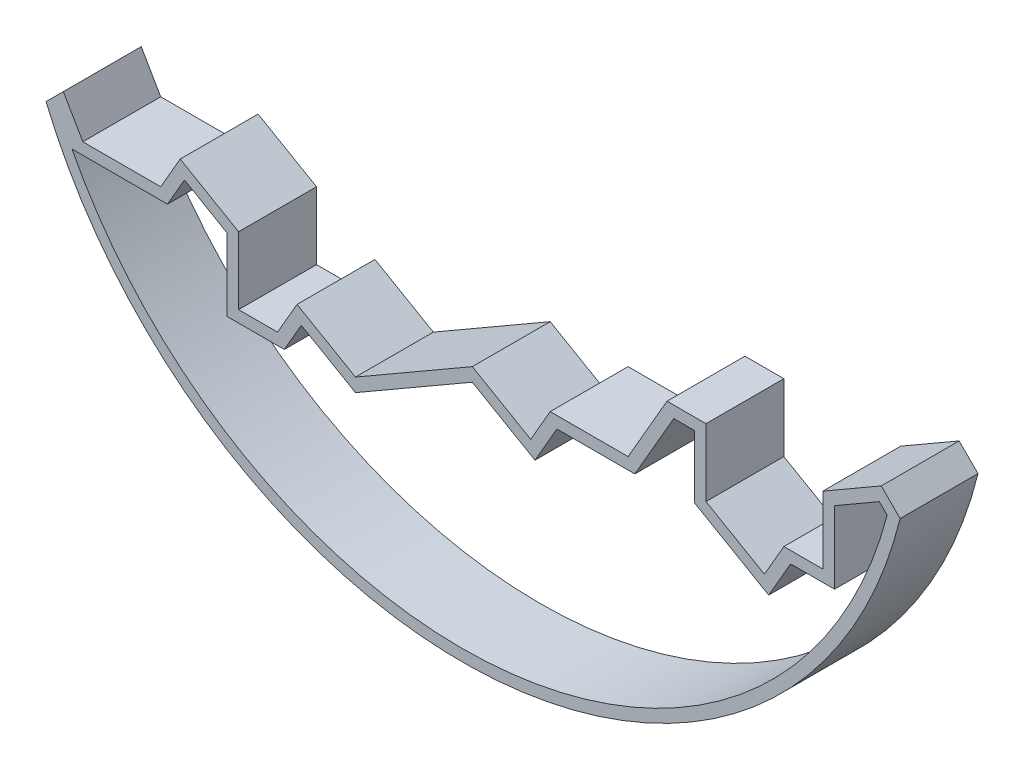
ISO-10303-21;
HEADER;
FILE_DESCRIPTION(('STEP AP214'),'2;1');
FILE_NAME('part.step','',(''),(''),'','','');
FILE_SCHEMA(('AUTOMOTIVE_DESIGN { 1 0 10303 214 1 1 1 1 }'));
ENDSEC;
DATA;
#1=APPLICATION_CONTEXT('core data for automotive mechanical design processes');
#2=APPLICATION_PROTOCOL_DEFINITION('international standard','automotive_design',2000,#1);
#3=PRODUCT_CONTEXT('',#1,'mechanical');
#4=PRODUCT('Part','Part','',(#3));
#5=PRODUCT_RELATED_PRODUCT_CATEGORY('part','',(#4));
#6=PRODUCT_DEFINITION_FORMATION('','',#4);
#7=PRODUCT_DEFINITION_CONTEXT('part definition',#1,'design');
#8=PRODUCT_DEFINITION('design','',#6,#7);
#9=PRODUCT_DEFINITION_SHAPE('','',#8);
#10=(LENGTH_UNIT() NAMED_UNIT(*) SI_UNIT(.MILLI.,.METRE.));
#11=(NAMED_UNIT(*) PLANE_ANGLE_UNIT() SI_UNIT($,.RADIAN.));
#12=(NAMED_UNIT(*) SI_UNIT($,.STERADIAN.) SOLID_ANGLE_UNIT());
#13=UNCERTAINTY_MEASURE_WITH_UNIT(LENGTH_MEASURE(1.E-05),#10,'distance_accuracy_value','');
#14=(GEOMETRIC_REPRESENTATION_CONTEXT(3) GLOBAL_UNCERTAINTY_ASSIGNED_CONTEXT((#13)) GLOBAL_UNIT_ASSIGNED_CONTEXT((#10,
#11,#12)) REPRESENTATION_CONTEXT('',''));
#15=CARTESIAN_POINT('',(0.,0.,0.));
#16=DIRECTION('',(0.,0.,1.));
#17=DIRECTION('',(1.,0.,0.));
#18=AXIS2_PLACEMENT_3D('',#15,#16,#17);
#19=CARTESIAN_POINT('',(-79.0600462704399,68.9861351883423,20.));
#20=DIRECTION('',(0.,0.,1.));
#21=DIRECTION('',(1.,0.,0.));
#22=AXIS2_PLACEMENT_3D('',#19,#20,#21);
#23=PLANE('',#22);
#24=DIRECTION('',(-0.707106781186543,-0.707106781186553,0.));
#25=VECTOR('',#24,1.);
#26=CARTESIAN_POINT('',(-181.460670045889,28.8101193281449,20.));
#27=LINE('',#26,#25);
#28=CARTESIAN_POINT('',(-181.460670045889,28.8101193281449,20.));
#29=VERTEX_POINT('',#28);
#30=CARTESIAN_POINT('',(-185.917059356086,24.3537300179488,20.));
#31=VERTEX_POINT('',#30);
#32=EDGE_CURVE('E470',#29,#31,#27,.T.);
#33=ORIENTED_EDGE('',*,*,#32,.T.);
#34=CARTESIAN_POINT('',(-79.0600462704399,68.9861351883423,20.));
#35=DIRECTION('',(0.,0.,1.));
#36=DIRECTION('',(1.,0.,0.));
#37=AXIS2_PLACEMENT_3D('',#34,#35,#36);
#38=CIRCLE('',#37,115.803595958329);
#39=CARTESIAN_POINT('',(33.3822497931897,41.2877075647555,20.));
#40=VERTEX_POINT('',#39);
#41=EDGE_CURVE('E473',#31,#40,#38,.T.);
#42=ORIENTED_EDGE('',*,*,#41,.T.);
#43=DIRECTION('',(-0.707106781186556,0.707106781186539,0.));
#44=VECTOR('',#43,1.);
#45=CARTESIAN_POINT('',(28.53932995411,46.1306274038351,20.));
#46=LINE('',#45,#44);
#47=CARTESIAN_POINT('',(28.53932995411,46.1306274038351,20.));
#48=VERTEX_POINT('',#47);
#49=EDGE_CURVE('E476',#40,#48,#46,.T.);
#50=ORIENTED_EDGE('',*,*,#49,.T.);
#51=DIRECTION('',(-0.866025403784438,-0.500000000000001,0.));
#52=VECTOR('',#51,1.);
#53=CARTESIAN_POINT('',(13.53932995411,37.4703733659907,20.));
#54=LINE('',#53,#52);
#55=CARTESIAN_POINT('',(13.53932995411,37.4703733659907,20.));
#56=VERTEX_POINT('',#55);
#57=EDGE_CURVE('E478',#48,#56,#54,.T.);
#58=ORIENTED_EDGE('',*,*,#57,.T.);
#59=DIRECTION('',(0.,-1.,0.));
#60=VECTOR('',#59,1.);
#61=CARTESIAN_POINT('',(13.53932995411,20.1498652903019,20.));
#62=LINE('',#61,#60);
#63=CARTESIAN_POINT('',(13.53932995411,20.1498652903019,20.));
#64=VERTEX_POINT('',#63);
#65=EDGE_CURVE('E480',#56,#64,#62,.T.);
#66=ORIENTED_EDGE('',*,*,#65,.T.);
#67=DIRECTION('',(-1.,0.,0.));
#68=VECTOR('',#67,1.);
#69=CARTESIAN_POINT('',(3.53932995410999,20.1498652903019,20.));
#70=LINE('',#69,#68);
#71=CARTESIAN_POINT('',(3.53932995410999,20.1498652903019,20.));
#72=VERTEX_POINT('',#71);
#73=EDGE_CURVE('E482',#64,#72,#70,.T.);
#74=ORIENTED_EDGE('',*,*,#73,.T.);
#75=DIRECTION('',(-0.499999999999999,-0.866025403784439,0.));
#76=VECTOR('',#75,1.);
#77=CARTESIAN_POINT('',(-1.46067004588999,11.4896112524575,20.));
#78=LINE('',#77,#76);
#79=CARTESIAN_POINT('',(-1.46067004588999,11.4896112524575,20.));
#80=VERTEX_POINT('',#79);
#81=EDGE_CURVE('E484',#72,#80,#78,.T.);
#82=ORIENTED_EDGE('',*,*,#81,.T.);
#83=DIRECTION('',(-0.866025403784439,0.5,0.));
#84=VECTOR('',#83,1.);
#85=CARTESIAN_POINT('',(-16.46067004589,20.1498652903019,20.));
#86=LINE('',#85,#84);
#87=CARTESIAN_POINT('',(-16.46067004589,20.1498652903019,20.));
#88=VERTEX_POINT('',#87);
#89=EDGE_CURVE('E486',#80,#88,#86,.T.);
#90=ORIENTED_EDGE('',*,*,#89,.T.);
#91=DIRECTION('',(0.,1.,0.));
#92=VECTOR('',#91,1.);
#93=CARTESIAN_POINT('',(-16.46067004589,37.4703733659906,20.));
#94=LINE('',#93,#92);
#95=CARTESIAN_POINT('',(-16.46067004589,37.4703733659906,20.));
#96=VERTEX_POINT('',#95);
#97=EDGE_CURVE('E488',#88,#96,#94,.T.);
#98=ORIENTED_EDGE('',*,*,#97,.T.);
#99=DIRECTION('',(-1.,0.,0.));
#100=VECTOR('',#99,1.);
#101=CARTESIAN_POINT('',(-26.4606700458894,37.4703733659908,20.));
#102=LINE('',#101,#100);
#103=CARTESIAN_POINT('',(-26.4606700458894,37.4703733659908,20.));
#104=VERTEX_POINT('',#103);
#105=EDGE_CURVE('E490',#96,#104,#102,.T.);
#106=ORIENTED_EDGE('',*,*,#105,.T.);
#107=DIRECTION('',(-0.499999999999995,-0.866025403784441,0.));
#108=VECTOR('',#107,1.);
#109=CARTESIAN_POINT('',(-36.4606700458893,20.1498652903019,20.));
#110=LINE('',#109,#108);
#111=CARTESIAN_POINT('',(-36.4606700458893,20.1498652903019,20.));
#112=VERTEX_POINT('',#111);
#113=EDGE_CURVE('E492',#104,#112,#110,.T.);
#114=ORIENTED_EDGE('',*,*,#113,.T.);
#115=DIRECTION('',(-1.,0.,0.));
#116=VECTOR('',#115,1.);
#117=CARTESIAN_POINT('',(-56.4606700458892,20.149865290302,20.));
#118=LINE('',#117,#116);
#119=CARTESIAN_POINT('',(-56.4606700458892,20.149865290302,20.));
#120=VERTEX_POINT('',#119);
#121=EDGE_CURVE('E494',#112,#120,#118,.T.);
#122=ORIENTED_EDGE('',*,*,#121,.T.);
#123=DIRECTION('',(-0.499999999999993,-0.866025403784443,0.));
#124=VECTOR('',#123,1.);
#125=CARTESIAN_POINT('',(-61.4606700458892,11.4896112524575,20.));
#126=LINE('',#125,#124);
#127=CARTESIAN_POINT('',(-61.4606700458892,11.4896112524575,20.));
#128=VERTEX_POINT('',#127);
#129=EDGE_CURVE('E496',#120,#128,#126,.T.);
#130=ORIENTED_EDGE('',*,*,#129,.T.);
#131=DIRECTION('',(-0.866025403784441,0.499999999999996,0.));
#132=VECTOR('',#131,1.);
#133=CARTESIAN_POINT('',(-76.4606700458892,20.1498652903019,20.));
#134=LINE('',#133,#132);
#135=CARTESIAN_POINT('',(-76.4606700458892,20.1498652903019,20.));
#136=VERTEX_POINT('',#135);
#137=EDGE_CURVE('E498',#128,#136,#134,.T.);
#138=ORIENTED_EDGE('',*,*,#137,.T.);
#139=DIRECTION('',(-0.866025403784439,-0.499999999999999,0.));
#140=VECTOR('',#139,1.);
#141=CARTESIAN_POINT('',(-106.460670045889,2.82935721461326,20.));
#142=LINE('',#141,#140);
#143=CARTESIAN_POINT('',(-106.460670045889,2.82935721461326,20.));
#144=VERTEX_POINT('',#143);
#145=EDGE_CURVE('E500',#136,#144,#142,.T.);
#146=ORIENTED_EDGE('',*,*,#145,.T.);
#147=DIRECTION('',(-0.866025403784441,0.499999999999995,0.));
#148=VECTOR('',#147,1.);
#149=CARTESIAN_POINT('',(-121.460670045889,11.4896112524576,20.));
#150=LINE('',#149,#148);
#151=CARTESIAN_POINT('',(-121.460670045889,11.4896112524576,20.));
#152=VERTEX_POINT('',#151);
#153=EDGE_CURVE('E502',#144,#152,#150,.T.);
#154=ORIENTED_EDGE('',*,*,#153,.T.);
#155=DIRECTION('',(-0.499999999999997,-0.86602540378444,0.));
#156=VECTOR('',#155,1.);
#157=CARTESIAN_POINT('',(-126.460670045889,2.82935721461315,20.));
#158=LINE('',#157,#156);
#159=CARTESIAN_POINT('',(-126.460670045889,2.82935721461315,20.));
#160=VERTEX_POINT('',#159);
#161=EDGE_CURVE('E504',#152,#160,#158,.T.);
#162=ORIENTED_EDGE('',*,*,#161,.T.);
#163=DIRECTION('',(-1.,0.,0.));
#164=VECTOR('',#163,1.);
#165=CARTESIAN_POINT('',(-136.460670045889,2.82935721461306,20.));
#166=LINE('',#165,#164);
#167=CARTESIAN_POINT('',(-136.460670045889,2.82935721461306,20.));
#168=VERTEX_POINT('',#167);
#169=EDGE_CURVE('E506',#160,#168,#166,.T.);
#170=ORIENTED_EDGE('',*,*,#169,.T.);
#171=DIRECTION('',(0.,1.,0.));
#172=VECTOR('',#171,1.);
#173=CARTESIAN_POINT('',(-136.460670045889,20.1498652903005,20.));
#174=LINE('',#173,#172);
#175=CARTESIAN_POINT('',(-136.460670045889,20.1498652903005,20.));
#176=VERTEX_POINT('',#175);
#177=EDGE_CURVE('E508',#168,#176,#174,.T.);
#178=ORIENTED_EDGE('',*,*,#177,.T.);
#179=DIRECTION('',(-0.866025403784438,0.500000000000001,0.));
#180=VECTOR('',#179,1.);
#181=CARTESIAN_POINT('',(-151.460670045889,28.8101193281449,20.));
#182=LINE('',#181,#180);
#183=CARTESIAN_POINT('',(-151.460670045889,28.8101193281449,20.));
#184=VERTEX_POINT('',#183);
#185=EDGE_CURVE('E510',#176,#184,#182,.T.);
#186=ORIENTED_EDGE('',*,*,#185,.T.);
#187=DIRECTION('',(-0.5,-0.866025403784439,0.));
#188=VECTOR('',#187,1.);
#189=CARTESIAN_POINT('',(-156.460670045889,20.1498652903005,20.));
#190=LINE('',#189,#188);
#191=CARTESIAN_POINT('',(-156.460670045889,20.1498652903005,20.));
#192=VERTEX_POINT('',#191);
#193=EDGE_CURVE('E512',#184,#192,#190,.T.);
#194=ORIENTED_EDGE('',*,*,#193,.T.);
#195=DIRECTION('',(-1.,0.,0.));
#196=VECTOR('',#195,1.);
#197=CARTESIAN_POINT('',(-176.460670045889,20.1498652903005,20.));
#198=LINE('',#197,#196);
#199=CARTESIAN_POINT('',(-176.460670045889,20.1498652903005,20.));
#200=VERTEX_POINT('',#199);
#201=EDGE_CURVE('E514',#192,#200,#198,.T.);
#202=ORIENTED_EDGE('',*,*,#201,.T.);
#203=DIRECTION('',(-0.5,0.866025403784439,0.));
#204=VECTOR('',#203,1.);
#205=CARTESIAN_POINT('',(-181.460670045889,28.8101193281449,20.));
#206=LINE('',#205,#204);
#207=EDGE_CURVE('E516',#200,#29,#206,.T.);
#208=ORIENTED_EDGE('',*,*,#207,.T.);
#209=EDGE_LOOP('',(#33,#42,#50,#58,#66,#74,#82,#90,#98,#106,#114,#122,#130,#138,#146,#154,#162,
#170,#178,#186,#194,#202,#208));
#210=FACE_BOUND('',#209,.T.);
#211=DIRECTION('',(-0.500000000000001,-0.866025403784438,0.));
#212=VECTOR('',#211,1.);
#213=CARTESIAN_POINT('',(-154.728619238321,17.1498652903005,20.));
#214=LINE('',#213,#212);
#215=CARTESIAN_POINT('',(-150.362593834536,24.7120431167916,20.));
#216=VERTEX_POINT('',#215);
#217=CARTESIAN_POINT('',(-154.728619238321,17.1498652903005,20.));
#218=VERTEX_POINT('',#217);
#219=EDGE_CURVE('E322',#216,#218,#214,.T.);
#220=ORIENTED_EDGE('',*,*,#219,.F.);
#221=DIRECTION('',(-0.866025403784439,0.5,0.));
#222=VECTOR('',#221,1.);
#223=CARTESIAN_POINT('',(-150.362593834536,24.7120431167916,20.));
#224=LINE('',#223,#222);
#225=CARTESIAN_POINT('',(-139.460670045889,18.4178144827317,20.));
#226=VERTEX_POINT('',#225);
#227=EDGE_CURVE('E314',#226,#216,#224,.T.);
#228=ORIENTED_EDGE('',*,*,#227,.F.);
#229=DIRECTION('',(0.,1.,0.));
#230=VECTOR('',#229,1.);
#231=CARTESIAN_POINT('',(-139.460670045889,18.4178144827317,20.));
#232=LINE('',#231,#230);
#233=CARTESIAN_POINT('',(-139.460670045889,-0.170642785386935,20.));
#234=VERTEX_POINT('',#233);
#235=EDGE_CURVE('E373',#234,#226,#232,.T.);
#236=ORIENTED_EDGE('',*,*,#235,.F.);
#237=DIRECTION('',(-1.,0.,0.));
#238=VECTOR('',#237,1.);
#239=CARTESIAN_POINT('',(-139.460670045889,-0.170642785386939,20.));
#240=LINE('',#239,#238);
#241=CARTESIAN_POINT('',(-124.72861923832,-0.170642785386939,20.));
#242=VERTEX_POINT('',#241);
#243=EDGE_CURVE('E371',#242,#234,#240,.T.);
#244=ORIENTED_EDGE('',*,*,#243,.F.);
#245=DIRECTION('',(-0.5,-0.866025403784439,0.));
#246=VECTOR('',#245,1.);
#247=CARTESIAN_POINT('',(-124.72861923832,-0.170642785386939,20.));
#248=LINE('',#247,#246);
#249=CARTESIAN_POINT('',(-120.362593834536,7.39153504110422,20.));
#250=VERTEX_POINT('',#249);
#251=EDGE_CURVE('E369',#250,#242,#248,.T.);
#252=ORIENTED_EDGE('',*,*,#251,.F.);
#253=DIRECTION('',(-0.866025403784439,0.5,0.));
#254=VECTOR('',#253,1.);
#255=CARTESIAN_POINT('',(-120.362593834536,7.39153504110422,20.));
#256=LINE('',#255,#254);
#257=CARTESIAN_POINT('',(-106.460670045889,-0.634744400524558,20.));
#258=VERTEX_POINT('',#257);
#259=EDGE_CURVE('E367',#258,#250,#256,.T.);
#260=ORIENTED_EDGE('',*,*,#259,.F.);
#261=DIRECTION('',(-0.866025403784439,-0.5,0.));
#262=VECTOR('',#261,1.);
#263=CARTESIAN_POINT('',(-106.460670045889,-0.634744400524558,20.));
#264=LINE('',#263,#262);
#265=CARTESIAN_POINT('',(-76.4606700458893,16.6857636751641,20.));
#266=VERTEX_POINT('',#265);
#267=EDGE_CURVE('E365',#266,#258,#264,.T.);
#268=ORIENTED_EDGE('',*,*,#267,.F.);
#269=DIRECTION('',(-0.866025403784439,0.5,0.));
#270=VECTOR('',#269,1.);
#271=CARTESIAN_POINT('',(-76.4606700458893,16.6857636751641,20.));
#272=LINE('',#271,#270);
#273=CARTESIAN_POINT('',(-60.3625938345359,7.39153504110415,20.));
#274=VERTEX_POINT('',#273);
#275=EDGE_CURVE('E363',#274,#266,#272,.T.);
#276=ORIENTED_EDGE('',*,*,#275,.F.);
#277=DIRECTION('',(-0.5,-0.866025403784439,0.));
#278=VECTOR('',#277,1.);
#279=CARTESIAN_POINT('',(-60.3625938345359,7.39153504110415,20.));
#280=LINE('',#279,#278);
#281=CARTESIAN_POINT('',(-54.7286192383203,17.149865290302,20.));
#282=VERTEX_POINT('',#281);
#283=EDGE_CURVE('E361',#282,#274,#280,.T.);
#284=ORIENTED_EDGE('',*,*,#283,.F.);
#285=DIRECTION('',(-1.,0.,0.));
#286=VECTOR('',#285,1.);
#287=CARTESIAN_POINT('',(-54.7286192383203,17.149865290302,20.));
#288=LINE('',#287,#286);
#289=CARTESIAN_POINT('',(-34.7286192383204,17.149865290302,20.));
#290=VERTEX_POINT('',#289);
#291=EDGE_CURVE('E359',#290,#282,#288,.T.);
#292=ORIENTED_EDGE('',*,*,#291,.F.);
#293=DIRECTION('',(-0.5,-0.866025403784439,0.));
#294=VECTOR('',#293,1.);
#295=CARTESIAN_POINT('',(-34.7286192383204,17.149865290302,20.));
#296=LINE('',#295,#294);
#297=CARTESIAN_POINT('',(-24.7286192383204,34.4703733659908,20.));
#298=VERTEX_POINT('',#297);
#299=EDGE_CURVE('E357',#298,#290,#296,.T.);
#300=ORIENTED_EDGE('',*,*,#299,.F.);
#301=DIRECTION('',(-1.,0.,0.));
#302=VECTOR('',#301,1.);
#303=CARTESIAN_POINT('',(-24.7286192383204,34.4703733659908,20.));
#304=LINE('',#303,#302);
#305=CARTESIAN_POINT('',(-19.46067004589,34.4703733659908,20.));
#306=VERTEX_POINT('',#305);
#307=EDGE_CURVE('E355',#306,#298,#304,.T.);
#308=ORIENTED_EDGE('',*,*,#307,.F.);
#309=DIRECTION('',(0.,1.,0.));
#310=VECTOR('',#309,1.);
#311=CARTESIAN_POINT('',(-19.46067004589,34.4703733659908,20.));
#312=LINE('',#311,#310);
#313=CARTESIAN_POINT('',(-19.46067004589,18.417814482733,20.));
#314=VERTEX_POINT('',#313);
#315=EDGE_CURVE('E353',#314,#306,#312,.T.);
#316=ORIENTED_EDGE('',*,*,#315,.F.);
#317=DIRECTION('',(-0.866025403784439,0.5,0.));
#318=VECTOR('',#317,1.);
#319=CARTESIAN_POINT('',(-19.46067004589,18.417814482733,20.));
#320=LINE('',#319,#318);
#321=CARTESIAN_POINT('',(-0.362593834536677,7.3915350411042,20.));
#322=VERTEX_POINT('',#321);
#323=EDGE_CURVE('E351',#322,#314,#320,.T.);
#324=ORIENTED_EDGE('',*,*,#323,.F.);
#325=DIRECTION('',(-0.5,-0.866025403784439,0.));
#326=VECTOR('',#325,1.);
#327=CARTESIAN_POINT('',(-0.362593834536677,7.3915350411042,20.));
#328=LINE('',#327,#326);
#329=CARTESIAN_POINT('',(5.27138076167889,17.1498652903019,20.));
#330=VERTEX_POINT('',#329);
#331=EDGE_CURVE('E349',#330,#322,#328,.T.);
#332=ORIENTED_EDGE('',*,*,#331,.F.);
#333=DIRECTION('',(-1.,0.,0.));
#334=VECTOR('',#333,1.);
#335=CARTESIAN_POINT('',(5.27138076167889,17.1498652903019,20.));
#336=LINE('',#335,#334);
#337=CARTESIAN_POINT('',(16.53932995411,17.1498652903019,20.));
#338=VERTEX_POINT('',#337);
#339=EDGE_CURVE('E347',#338,#330,#336,.T.);
#340=ORIENTED_EDGE('',*,*,#339,.F.);
#341=DIRECTION('',(0.,-1.,0.));
#342=VECTOR('',#341,1.);
#343=CARTESIAN_POINT('',(16.53932995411,17.1498652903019,20.));
#344=LINE('',#343,#342);
#345=CARTESIAN_POINT('',(16.53932995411,35.7383225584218,20.));
#346=VERTEX_POINT('',#345);
#347=EDGE_CURVE('E345',#346,#338,#344,.T.);
#348=ORIENTED_EDGE('',*,*,#347,.F.);
#349=DIRECTION('',(-0.866025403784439,-0.5,0.));
#350=VECTOR('',#349,1.);
#351=CARTESIAN_POINT('',(16.53932995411,35.7383225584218,20.));
#352=LINE('',#351,#350);
#353=CARTESIAN_POINT('',(28.0457559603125,42.3815607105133,20.));
#354=VERTEX_POINT('',#353);
#355=EDGE_CURVE('E343',#354,#346,#352,.T.);
#356=ORIENTED_EDGE('',*,*,#355,.F.);
#357=DIRECTION('',(-0.707106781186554,0.707106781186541,0.));
#358=VECTOR('',#357,1.);
#359=CARTESIAN_POINT('',(28.0457559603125,42.3815607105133,20.));
#360=LINE('',#359,#358);
#361=CARTESIAN_POINT('',(30.0543005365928,40.373016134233,20.));
#362=VERTEX_POINT('',#361);
#363=EDGE_CURVE('E341',#362,#354,#360,.T.);
#364=ORIENTED_EDGE('',*,*,#363,.F.);
#365=CARTESIAN_POINT('',(-79.0600462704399,68.9861351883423,20.));
#366=DIRECTION('',(0.,0.,1.));
#367=DIRECTION('',(1.,0.,0.));
#368=AXIS2_PLACEMENT_3D('',#365,#366,#367);
#369=CIRCLE('',#368,112.803595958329);
#370=CARTESIAN_POINT('',(-179.248131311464,17.1498652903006,20.));
#371=VERTEX_POINT('',#370);
#372=EDGE_CURVE('E337',#371,#362,#369,.T.);
#373=ORIENTED_EDGE('',*,*,#372,.F.);
#374=DIRECTION('',(-1.,0.,0.));
#375=VECTOR('',#374,1.);
#376=CARTESIAN_POINT('',(-179.248131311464,17.1498652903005,20.));
#377=LINE('',#376,#375);
#378=EDGE_CURVE('E335',#218,#371,#377,.T.);
#379=ORIENTED_EDGE('',*,*,#378,.F.);
#380=EDGE_LOOP('',(#220,#228,#236,#244,#252,#260,#268,#276,#284,#292,#300,#308,#316,#324,#332,
#340,#348,#356,#364,#373,#379));
#381=FACE_BOUND('',#380,.T.);
#382=ADVANCED_FACE('F33',(#210,#381),#23,.T.);
#383=CARTESIAN_POINT('',(-79.0600462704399,68.9861351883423,0.));
#384=DIRECTION('',(0.,0.,1.));
#385=DIRECTION('',(1.,0.,0.));
#386=AXIS2_PLACEMENT_3D('',#383,#384,#385);
#387=PLANE('',#386);
#388=DIRECTION('',(-0.707106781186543,-0.707106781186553,0.));
#389=VECTOR('',#388,1.);
#390=CARTESIAN_POINT('',(-181.460670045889,28.8101193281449,0.));
#391=LINE('',#390,#389);
#392=CARTESIAN_POINT('',(-181.460670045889,28.8101193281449,0.));
#393=VERTEX_POINT('',#392);
#394=CARTESIAN_POINT('',(-185.917059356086,24.3537300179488,0.));
#395=VERTEX_POINT('',#394);
#396=EDGE_CURVE('E330',#393,#395,#391,.T.);
#397=ORIENTED_EDGE('',*,*,#396,.F.);
#398=DIRECTION('',(-0.5,0.866025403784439,0.));
#399=VECTOR('',#398,1.);
#400=CARTESIAN_POINT('',(-181.460670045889,28.8101193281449,0.));
#401=LINE('',#400,#399);
#402=CARTESIAN_POINT('',(-176.460670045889,20.1498652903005,0.));
#403=VERTEX_POINT('',#402);
#404=EDGE_CURVE('E474',#403,#393,#401,.T.);
#405=ORIENTED_EDGE('',*,*,#404,.F.);
#406=DIRECTION('',(-1.,0.,0.));
#407=VECTOR('',#406,1.);
#408=CARTESIAN_POINT('',(-176.460670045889,20.1498652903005,0.));
#409=LINE('',#408,#407);
#410=CARTESIAN_POINT('',(-156.460670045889,20.1498652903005,0.));
#411=VERTEX_POINT('',#410);
#412=EDGE_CURVE('E561',#411,#403,#409,.T.);
#413=ORIENTED_EDGE('',*,*,#412,.F.);
#414=DIRECTION('',(-0.5,-0.866025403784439,0.));
#415=VECTOR('',#414,1.);
#416=CARTESIAN_POINT('',(-156.460670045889,20.1498652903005,0.));
#417=LINE('',#416,#415);
#418=CARTESIAN_POINT('',(-151.460670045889,28.8101193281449,0.));
#419=VERTEX_POINT('',#418);
#420=EDGE_CURVE('E559',#419,#411,#417,.T.);
#421=ORIENTED_EDGE('',*,*,#420,.F.);
#422=DIRECTION('',(-0.866025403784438,0.500000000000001,0.));
#423=VECTOR('',#422,1.);
#424=CARTESIAN_POINT('',(-151.460670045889,28.8101193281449,0.));
#425=LINE('',#424,#423);
#426=CARTESIAN_POINT('',(-136.460670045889,20.1498652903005,0.));
#427=VERTEX_POINT('',#426);
#428=EDGE_CURVE('E557',#427,#419,#425,.T.);
#429=ORIENTED_EDGE('',*,*,#428,.F.);
#430=DIRECTION('',(0.,1.,0.));
#431=VECTOR('',#430,1.);
#432=CARTESIAN_POINT('',(-136.460670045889,20.1498652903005,0.));
#433=LINE('',#432,#431);
#434=CARTESIAN_POINT('',(-136.460670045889,2.82935721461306,0.));
#435=VERTEX_POINT('',#434);
#436=EDGE_CURVE('E555',#435,#427,#433,.T.);
#437=ORIENTED_EDGE('',*,*,#436,.F.);
#438=DIRECTION('',(-1.,0.,0.));
#439=VECTOR('',#438,1.);
#440=CARTESIAN_POINT('',(-136.460670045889,2.82935721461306,0.));
#441=LINE('',#440,#439);
#442=CARTESIAN_POINT('',(-126.460670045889,2.82935721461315,0.));
#443=VERTEX_POINT('',#442);
#444=EDGE_CURVE('E553',#443,#435,#441,.T.);
#445=ORIENTED_EDGE('',*,*,#444,.F.);
#446=DIRECTION('',(-0.499999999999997,-0.86602540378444,0.));
#447=VECTOR('',#446,1.);
#448=CARTESIAN_POINT('',(-126.460670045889,2.82935721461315,0.));
#449=LINE('',#448,#447);
#450=CARTESIAN_POINT('',(-121.460670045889,11.4896112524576,0.));
#451=VERTEX_POINT('',#450);
#452=EDGE_CURVE('E551',#451,#443,#449,.T.);
#453=ORIENTED_EDGE('',*,*,#452,.F.);
#454=DIRECTION('',(-0.866025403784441,0.499999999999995,0.));
#455=VECTOR('',#454,1.);
#456=CARTESIAN_POINT('',(-121.460670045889,11.4896112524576,0.));
#457=LINE('',#456,#455);
#458=CARTESIAN_POINT('',(-106.460670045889,2.82935721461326,0.));
#459=VERTEX_POINT('',#458);
#460=EDGE_CURVE('E549',#459,#451,#457,.T.);
#461=ORIENTED_EDGE('',*,*,#460,.F.);
#462=DIRECTION('',(-0.866025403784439,-0.499999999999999,0.));
#463=VECTOR('',#462,1.);
#464=CARTESIAN_POINT('',(-106.460670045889,2.82935721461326,0.));
#465=LINE('',#464,#463);
#466=CARTESIAN_POINT('',(-76.4606700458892,20.1498652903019,0.));
#467=VERTEX_POINT('',#466);
#468=EDGE_CURVE('E547',#467,#459,#465,.T.);
#469=ORIENTED_EDGE('',*,*,#468,.F.);
#470=DIRECTION('',(-0.866025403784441,0.499999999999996,0.));
#471=VECTOR('',#470,1.);
#472=CARTESIAN_POINT('',(-76.4606700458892,20.1498652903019,0.));
#473=LINE('',#472,#471);
#474=CARTESIAN_POINT('',(-61.4606700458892,11.4896112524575,0.));
#475=VERTEX_POINT('',#474);
#476=EDGE_CURVE('E545',#475,#467,#473,.T.);
#477=ORIENTED_EDGE('',*,*,#476,.F.);
#478=DIRECTION('',(-0.499999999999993,-0.866025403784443,0.));
#479=VECTOR('',#478,1.);
#480=CARTESIAN_POINT('',(-61.4606700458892,11.4896112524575,0.));
#481=LINE('',#480,#479);
#482=CARTESIAN_POINT('',(-56.4606700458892,20.149865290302,0.));
#483=VERTEX_POINT('',#482);
#484=EDGE_CURVE('E543',#483,#475,#481,.T.);
#485=ORIENTED_EDGE('',*,*,#484,.F.);
#486=DIRECTION('',(-1.,0.,0.));
#487=VECTOR('',#486,1.);
#488=CARTESIAN_POINT('',(-56.4606700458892,20.149865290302,0.));
#489=LINE('',#488,#487);
#490=CARTESIAN_POINT('',(-36.4606700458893,20.1498652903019,0.));
#491=VERTEX_POINT('',#490);
#492=EDGE_CURVE('E541',#491,#483,#489,.T.);
#493=ORIENTED_EDGE('',*,*,#492,.F.);
#494=DIRECTION('',(-0.499999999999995,-0.866025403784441,0.));
#495=VECTOR('',#494,1.);
#496=CARTESIAN_POINT('',(-36.4606700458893,20.1498652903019,0.));
#497=LINE('',#496,#495);
#498=CARTESIAN_POINT('',(-26.4606700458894,37.4703733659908,0.));
#499=VERTEX_POINT('',#498);
#500=EDGE_CURVE('E539',#499,#491,#497,.T.);
#501=ORIENTED_EDGE('',*,*,#500,.F.);
#502=DIRECTION('',(-1.,0.,0.));
#503=VECTOR('',#502,1.);
#504=CARTESIAN_POINT('',(-26.4606700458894,37.4703733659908,0.));
#505=LINE('',#504,#503);
#506=CARTESIAN_POINT('',(-16.46067004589,37.4703733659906,0.));
#507=VERTEX_POINT('',#506);
#508=EDGE_CURVE('E537',#507,#499,#505,.T.);
#509=ORIENTED_EDGE('',*,*,#508,.F.);
#510=DIRECTION('',(0.,1.,0.));
#511=VECTOR('',#510,1.);
#512=CARTESIAN_POINT('',(-16.46067004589,37.4703733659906,0.));
#513=LINE('',#512,#511);
#514=CARTESIAN_POINT('',(-16.46067004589,20.1498652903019,0.));
#515=VERTEX_POINT('',#514);
#516=EDGE_CURVE('E535',#515,#507,#513,.T.);
#517=ORIENTED_EDGE('',*,*,#516,.F.);
#518=DIRECTION('',(-0.866025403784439,0.5,0.));
#519=VECTOR('',#518,1.);
#520=CARTESIAN_POINT('',(-16.46067004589,20.1498652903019,0.));
#521=LINE('',#520,#519);
#522=CARTESIAN_POINT('',(-1.46067004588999,11.4896112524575,0.));
#523=VERTEX_POINT('',#522);
#524=EDGE_CURVE('E533',#523,#515,#521,.T.);
#525=ORIENTED_EDGE('',*,*,#524,.F.);
#526=DIRECTION('',(-0.499999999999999,-0.866025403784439,0.));
#527=VECTOR('',#526,1.);
#528=CARTESIAN_POINT('',(-1.46067004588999,11.4896112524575,0.));
#529=LINE('',#528,#527);
#530=CARTESIAN_POINT('',(3.53932995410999,20.1498652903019,0.));
#531=VERTEX_POINT('',#530);
#532=EDGE_CURVE('E531',#531,#523,#529,.T.);
#533=ORIENTED_EDGE('',*,*,#532,.F.);
#534=DIRECTION('',(-1.,0.,0.));
#535=VECTOR('',#534,1.);
#536=CARTESIAN_POINT('',(3.53932995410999,20.1498652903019,0.));
#537=LINE('',#536,#535);
#538=CARTESIAN_POINT('',(13.53932995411,20.1498652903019,0.));
#539=VERTEX_POINT('',#538);
#540=EDGE_CURVE('E529',#539,#531,#537,.T.);
#541=ORIENTED_EDGE('',*,*,#540,.F.);
#542=DIRECTION('',(0.,-1.,0.));
#543=VECTOR('',#542,1.);
#544=CARTESIAN_POINT('',(13.53932995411,20.1498652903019,0.));
#545=LINE('',#544,#543);
#546=CARTESIAN_POINT('',(13.53932995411,37.4703733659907,0.));
#547=VERTEX_POINT('',#546);
#548=EDGE_CURVE('E527',#547,#539,#545,.T.);
#549=ORIENTED_EDGE('',*,*,#548,.F.);
#550=DIRECTION('',(-0.866025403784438,-0.500000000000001,0.));
#551=VECTOR('',#550,1.);
#552=CARTESIAN_POINT('',(13.53932995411,37.4703733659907,0.));
#553=LINE('',#552,#551);
#554=CARTESIAN_POINT('',(28.53932995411,46.1306274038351,0.));
#555=VERTEX_POINT('',#554);
#556=EDGE_CURVE('E525',#555,#547,#553,.T.);
#557=ORIENTED_EDGE('',*,*,#556,.F.);
#558=DIRECTION('',(-0.707106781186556,0.707106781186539,0.));
#559=VECTOR('',#558,1.);
#560=CARTESIAN_POINT('',(28.53932995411,46.1306274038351,0.));
#561=LINE('',#560,#559);
#562=CARTESIAN_POINT('',(33.3822497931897,41.2877075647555,0.));
#563=VERTEX_POINT('',#562);
#564=EDGE_CURVE('E523',#563,#555,#561,.T.);
#565=ORIENTED_EDGE('',*,*,#564,.F.);
#566=CARTESIAN_POINT('',(-79.0600462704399,68.9861351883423,0.));
#567=DIRECTION('',(0.,0.,1.));
#568=DIRECTION('',(1.,0.,0.));
#569=AXIS2_PLACEMENT_3D('',#566,#567,#568);
#570=CIRCLE('',#569,115.803595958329);
#571=EDGE_CURVE('E521',#395,#563,#570,.T.);
#572=ORIENTED_EDGE('',*,*,#571,.F.);
#573=EDGE_LOOP('',(#397,#405,#413,#421,#429,#437,#445,#453,#461,#469,#477,#485,#493,#501,#509,
#517,#525,#533,#541,#549,#557,#565,#572));
#574=FACE_BOUND('',#573,.T.);
#575=DIRECTION('',(-0.866025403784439,0.5,0.));
#576=VECTOR('',#575,1.);
#577=CARTESIAN_POINT('',(-150.362593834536,24.7120431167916,0.));
#578=LINE('',#577,#576);
#579=CARTESIAN_POINT('',(-139.460670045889,18.4178144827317,0.));
#580=VERTEX_POINT('',#579);
#581=CARTESIAN_POINT('',(-150.362593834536,24.7120431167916,0.));
#582=VERTEX_POINT('',#581);
#583=EDGE_CURVE('E56',#580,#582,#578,.T.);
#584=ORIENTED_EDGE('',*,*,#583,.T.);
#585=DIRECTION('',(-0.500000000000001,-0.866025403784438,0.));
#586=VECTOR('',#585,1.);
#587=CARTESIAN_POINT('',(-154.728619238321,17.1498652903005,0.));
#588=LINE('',#587,#586);
#589=CARTESIAN_POINT('',(-154.728619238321,17.1498652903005,0.));
#590=VERTEX_POINT('',#589);
#591=EDGE_CURVE('E329',#582,#590,#588,.T.);
#592=ORIENTED_EDGE('',*,*,#591,.T.);
#593=DIRECTION('',(-1.,0.,0.));
#594=VECTOR('',#593,1.);
#595=CARTESIAN_POINT('',(-179.248131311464,17.1498652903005,0.));
#596=LINE('',#595,#594);
#597=CARTESIAN_POINT('',(-179.248131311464,17.1498652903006,0.));
#598=VERTEX_POINT('',#597);
#599=EDGE_CURVE('E377',#590,#598,#596,.T.);
#600=ORIENTED_EDGE('',*,*,#599,.T.);
#601=CARTESIAN_POINT('',(-79.0600462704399,68.9861351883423,0.));
#602=DIRECTION('',(0.,0.,1.));
#603=DIRECTION('',(1.,0.,0.));
#604=AXIS2_PLACEMENT_3D('',#601,#602,#603);
#605=CIRCLE('',#604,112.803595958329);
#606=CARTESIAN_POINT('',(30.0543005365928,40.373016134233,0.));
#607=VERTEX_POINT('',#606);
#608=EDGE_CURVE('E380',#598,#607,#605,.T.);
#609=ORIENTED_EDGE('',*,*,#608,.T.);
#610=DIRECTION('',(-0.707106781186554,0.707106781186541,0.));
#611=VECTOR('',#610,1.);
#612=CARTESIAN_POINT('',(28.0457559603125,42.3815607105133,0.));
#613=LINE('',#612,#611);
#614=CARTESIAN_POINT('',(28.0457559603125,42.3815607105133,0.));
#615=VERTEX_POINT('',#614);
#616=EDGE_CURVE('E383',#607,#615,#613,.T.);
#617=ORIENTED_EDGE('',*,*,#616,.T.);
#618=DIRECTION('',(-0.866025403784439,-0.5,0.));
#619=VECTOR('',#618,1.);
#620=CARTESIAN_POINT('',(16.53932995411,35.7383225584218,0.));
#621=LINE('',#620,#619);
#622=CARTESIAN_POINT('',(16.53932995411,35.7383225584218,0.));
#623=VERTEX_POINT('',#622);
#624=EDGE_CURVE('E386',#615,#623,#621,.T.);
#625=ORIENTED_EDGE('',*,*,#624,.T.);
#626=DIRECTION('',(0.,-1.,0.));
#627=VECTOR('',#626,1.);
#628=CARTESIAN_POINT('',(16.53932995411,17.1498652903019,0.));
#629=LINE('',#628,#627);
#630=CARTESIAN_POINT('',(16.53932995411,17.1498652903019,0.));
#631=VERTEX_POINT('',#630);
#632=EDGE_CURVE('E389',#623,#631,#629,.T.);
#633=ORIENTED_EDGE('',*,*,#632,.T.);
#634=DIRECTION('',(-1.,0.,0.));
#635=VECTOR('',#634,1.);
#636=CARTESIAN_POINT('',(5.27138076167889,17.1498652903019,0.));
#637=LINE('',#636,#635);
#638=CARTESIAN_POINT('',(5.27138076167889,17.1498652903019,0.));
#639=VERTEX_POINT('',#638);
#640=EDGE_CURVE('E392',#631,#639,#637,.T.);
#641=ORIENTED_EDGE('',*,*,#640,.T.);
#642=DIRECTION('',(-0.5,-0.866025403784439,0.));
#643=VECTOR('',#642,1.);
#644=CARTESIAN_POINT('',(-0.362593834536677,7.3915350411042,0.));
#645=LINE('',#644,#643);
#646=CARTESIAN_POINT('',(-0.362593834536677,7.3915350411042,0.));
#647=VERTEX_POINT('',#646);
#648=EDGE_CURVE('E395',#639,#647,#645,.T.);
#649=ORIENTED_EDGE('',*,*,#648,.T.);
#650=DIRECTION('',(-0.866025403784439,0.5,0.));
#651=VECTOR('',#650,1.);
#652=CARTESIAN_POINT('',(-19.46067004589,18.417814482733,0.));
#653=LINE('',#652,#651);
#654=CARTESIAN_POINT('',(-19.46067004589,18.417814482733,0.));
#655=VERTEX_POINT('',#654);
#656=EDGE_CURVE('E398',#647,#655,#653,.T.);
#657=ORIENTED_EDGE('',*,*,#656,.T.);
#658=DIRECTION('',(0.,1.,0.));
#659=VECTOR('',#658,1.);
#660=CARTESIAN_POINT('',(-19.46067004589,34.4703733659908,0.));
#661=LINE('',#660,#659);
#662=CARTESIAN_POINT('',(-19.46067004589,34.4703733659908,0.));
#663=VERTEX_POINT('',#662);
#664=EDGE_CURVE('E401',#655,#663,#661,.T.);
#665=ORIENTED_EDGE('',*,*,#664,.T.);
#666=DIRECTION('',(-1.,0.,0.));
#667=VECTOR('',#666,1.);
#668=CARTESIAN_POINT('',(-24.7286192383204,34.4703733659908,0.));
#669=LINE('',#668,#667);
#670=CARTESIAN_POINT('',(-24.7286192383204,34.4703733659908,0.));
#671=VERTEX_POINT('',#670);
#672=EDGE_CURVE('E404',#663,#671,#669,.T.);
#673=ORIENTED_EDGE('',*,*,#672,.T.);
#674=DIRECTION('',(-0.5,-0.866025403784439,0.));
#675=VECTOR('',#674,1.);
#676=CARTESIAN_POINT('',(-34.7286192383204,17.149865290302,0.));
#677=LINE('',#676,#675);
#678=CARTESIAN_POINT('',(-34.7286192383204,17.149865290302,0.));
#679=VERTEX_POINT('',#678);
#680=EDGE_CURVE('E407',#671,#679,#677,.T.);
#681=ORIENTED_EDGE('',*,*,#680,.T.);
#682=DIRECTION('',(-1.,0.,0.));
#683=VECTOR('',#682,1.);
#684=CARTESIAN_POINT('',(-54.7286192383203,17.149865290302,0.));
#685=LINE('',#684,#683);
#686=CARTESIAN_POINT('',(-54.7286192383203,17.149865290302,0.));
#687=VERTEX_POINT('',#686);
#688=EDGE_CURVE('E410',#679,#687,#685,.T.);
#689=ORIENTED_EDGE('',*,*,#688,.T.);
#690=DIRECTION('',(-0.5,-0.866025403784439,0.));
#691=VECTOR('',#690,1.);
#692=CARTESIAN_POINT('',(-60.3625938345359,7.39153504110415,0.));
#693=LINE('',#692,#691);
#694=CARTESIAN_POINT('',(-60.3625938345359,7.39153504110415,0.));
#695=VERTEX_POINT('',#694);
#696=EDGE_CURVE('E413',#687,#695,#693,.T.);
#697=ORIENTED_EDGE('',*,*,#696,.T.);
#698=DIRECTION('',(-0.866025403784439,0.5,0.));
#699=VECTOR('',#698,1.);
#700=CARTESIAN_POINT('',(-76.4606700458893,16.6857636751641,0.));
#701=LINE('',#700,#699);
#702=CARTESIAN_POINT('',(-76.4606700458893,16.6857636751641,0.));
#703=VERTEX_POINT('',#702);
#704=EDGE_CURVE('E416',#695,#703,#701,.T.);
#705=ORIENTED_EDGE('',*,*,#704,.T.);
#706=DIRECTION('',(-0.866025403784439,-0.5,0.));
#707=VECTOR('',#706,1.);
#708=CARTESIAN_POINT('',(-106.460670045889,-0.634744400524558,0.));
#709=LINE('',#708,#707);
#710=CARTESIAN_POINT('',(-106.460670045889,-0.634744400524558,0.));
#711=VERTEX_POINT('',#710);
#712=EDGE_CURVE('E419',#703,#711,#709,.T.);
#713=ORIENTED_EDGE('',*,*,#712,.T.);
#714=DIRECTION('',(-0.866025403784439,0.5,0.));
#715=VECTOR('',#714,1.);
#716=CARTESIAN_POINT('',(-120.362593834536,7.39153504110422,0.));
#717=LINE('',#716,#715);
#718=CARTESIAN_POINT('',(-120.362593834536,7.39153504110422,0.));
#719=VERTEX_POINT('',#718);
#720=EDGE_CURVE('E422',#711,#719,#717,.T.);
#721=ORIENTED_EDGE('',*,*,#720,.T.);
#722=DIRECTION('',(-0.5,-0.866025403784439,0.));
#723=VECTOR('',#722,1.);
#724=CARTESIAN_POINT('',(-124.72861923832,-0.170642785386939,0.));
#725=LINE('',#724,#723);
#726=CARTESIAN_POINT('',(-124.72861923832,-0.170642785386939,0.));
#727=VERTEX_POINT('',#726);
#728=EDGE_CURVE('E425',#719,#727,#725,.T.);
#729=ORIENTED_EDGE('',*,*,#728,.T.);
#730=DIRECTION('',(-1.,0.,0.));
#731=VECTOR('',#730,1.);
#732=CARTESIAN_POINT('',(-139.460670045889,-0.170642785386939,0.));
#733=LINE('',#732,#731);
#734=CARTESIAN_POINT('',(-139.460670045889,-0.170642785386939,0.));
#735=VERTEX_POINT('',#734);
#736=EDGE_CURVE('E428',#727,#735,#733,.T.);
#737=ORIENTED_EDGE('',*,*,#736,.T.);
#738=DIRECTION('',(0.,1.,0.));
#739=VECTOR('',#738,1.);
#740=CARTESIAN_POINT('',(-139.460670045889,18.4178144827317,0.));
#741=LINE('',#740,#739);
#742=EDGE_CURVE('E323',#735,#580,#741,.T.);
#743=ORIENTED_EDGE('',*,*,#742,.T.);
#744=EDGE_LOOP('',(#584,#592,#600,#609,#617,#625,#633,#641,#649,#657,#665,#673,#681,#689,#697,
#705,#713,#721,#729,#737,#743));
#745=FACE_BOUND('',#744,.T.);
#746=ADVANCED_FACE('F636',(#574,#745),#387,.F.);
#747=CARTESIAN_POINT('',(-181.460670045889,28.8101193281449,20.));
#748=DIRECTION('',(0.707106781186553,-0.707106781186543,0.));
#749=DIRECTION('',(0.707106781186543,0.707106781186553,0.));
#750=AXIS2_PLACEMENT_3D('',#747,#748,#749);
#751=PLANE('',#750);
#752=ORIENTED_EDGE('',*,*,#396,.T.);
#753=DIRECTION('',(0.,0.,-1.));
#754=VECTOR('',#753,1.);
#755=CARTESIAN_POINT('',(-185.917059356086,24.3537300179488,20.));
#756=LINE('',#755,#754);
#757=EDGE_CURVE('E11',#31,#395,#756,.T.);
#758=ORIENTED_EDGE('',*,*,#757,.F.);
#759=ORIENTED_EDGE('',*,*,#32,.F.);
#760=DIRECTION('',(0.,0.,-1.));
#761=VECTOR('',#760,1.);
#762=CARTESIAN_POINT('',(-181.460670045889,28.8101193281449,20.));
#763=LINE('',#762,#761);
#764=EDGE_CURVE('E518',#29,#393,#763,.T.);
#765=ORIENTED_EDGE('',*,*,#764,.T.);
#766=EDGE_LOOP('',(#752,#758,#759,#765));
#767=FACE_BOUND('',#766,.T.);
#768=ADVANCED_FACE('F35',(#767),#751,.F.);
#769=CARTESIAN_POINT('',(-79.0600462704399,68.9861351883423,20.));
#770=DIRECTION('',(0.,0.,-1.));
#771=DIRECTION('',(-1.,0.,0.));
#772=AXIS2_PLACEMENT_3D('',#769,#770,#771);
#773=CYLINDRICAL_SURFACE('',#772,115.803595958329);
#774=ORIENTED_EDGE('',*,*,#571,.T.);
#775=DIRECTION('',(0.,0.,-1.));
#776=VECTOR('',#775,1.);
#777=CARTESIAN_POINT('',(33.3822497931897,41.2877075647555,20.));
#778=LINE('',#777,#776);
#779=EDGE_CURVE('E41',#40,#563,#778,.T.);
#780=ORIENTED_EDGE('',*,*,#779,.F.);
#781=ORIENTED_EDGE('',*,*,#41,.F.);
#782=ORIENTED_EDGE('',*,*,#757,.T.);
#783=EDGE_LOOP('',(#774,#780,#781,#782));
#784=FACE_BOUND('',#783,.T.);
#785=ADVANCED_FACE('F653',(#784),#773,.T.);
#786=CARTESIAN_POINT('',(28.53932995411,46.1306274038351,20.));
#787=DIRECTION('',(-0.707106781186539,-0.707106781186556,0.));
#788=DIRECTION('',(0.707106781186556,-0.707106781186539,0.));
#789=AXIS2_PLACEMENT_3D('',#786,#787,#788);
#790=PLANE('',#789);
#791=ORIENTED_EDGE('',*,*,#564,.T.);
#792=DIRECTION('',(0.,0.,-1.));
#793=VECTOR('',#792,1.);
#794=CARTESIAN_POINT('',(28.53932995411,46.1306274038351,20.));
#795=LINE('',#794,#793);
#796=EDGE_CURVE('E623',#48,#555,#795,.T.);
#797=ORIENTED_EDGE('',*,*,#796,.F.);
#798=ORIENTED_EDGE('',*,*,#49,.F.);
#799=ORIENTED_EDGE('',*,*,#779,.T.);
#800=EDGE_LOOP('',(#791,#797,#798,#799));
#801=FACE_BOUND('',#800,.T.);
#802=ADVANCED_FACE('F630',(#801),#790,.F.);
#803=CARTESIAN_POINT('',(13.53932995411,37.4703733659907,20.));
#804=DIRECTION('',(0.500000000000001,-0.866025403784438,0.));
#805=DIRECTION('',(0.866025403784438,0.500000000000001,0.));
#806=AXIS2_PLACEMENT_3D('',#803,#804,#805);
#807=PLANE('',#806);
#808=ORIENTED_EDGE('',*,*,#556,.T.);
#809=DIRECTION('',(0.,0.,-1.));
#810=VECTOR('',#809,1.);
#811=CARTESIAN_POINT('',(13.53932995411,37.4703733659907,20.));
#812=LINE('',#811,#810);
#813=EDGE_CURVE('E620',#56,#547,#812,.T.);
#814=ORIENTED_EDGE('',*,*,#813,.F.);
#815=ORIENTED_EDGE('',*,*,#57,.F.);
#816=ORIENTED_EDGE('',*,*,#796,.T.);
#817=EDGE_LOOP('',(#808,#814,#815,#816));
#818=FACE_BOUND('',#817,.T.);
#819=ADVANCED_FACE('F642',(#818),#807,.F.);
#820=CARTESIAN_POINT('',(13.53932995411,20.1498652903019,20.));
#821=DIRECTION('',(1.,0.,0.));
#822=DIRECTION('',(0.,1.,0.));
#823=AXIS2_PLACEMENT_3D('',#820,#821,#822);
#824=PLANE('',#823);
#825=ORIENTED_EDGE('',*,*,#548,.T.);
#826=DIRECTION('',(0.,0.,-1.));
#827=VECTOR('',#826,1.);
#828=CARTESIAN_POINT('',(13.53932995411,20.1498652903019,20.));
#829=LINE('',#828,#827);
#830=EDGE_CURVE('E617',#64,#539,#829,.T.);
#831=ORIENTED_EDGE('',*,*,#830,.F.);
#832=ORIENTED_EDGE('',*,*,#65,.F.);
#833=ORIENTED_EDGE('',*,*,#813,.T.);
#834=EDGE_LOOP('',(#825,#831,#832,#833));
#835=FACE_BOUND('',#834,.T.);
#836=ADVANCED_FACE('F646',(#835),#824,.F.);
#837=CARTESIAN_POINT('',(3.53932995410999,20.1498652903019,20.));
#838=DIRECTION('',(0.,-1.,0.));
#839=DIRECTION('',(1.,0.,0.));
#840=AXIS2_PLACEMENT_3D('',#837,#838,#839);
#841=PLANE('',#840);
#842=ORIENTED_EDGE('',*,*,#540,.T.);
#843=DIRECTION('',(0.,0.,-1.));
#844=VECTOR('',#843,1.);
#845=CARTESIAN_POINT('',(3.53932995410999,20.1498652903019,20.));
#846=LINE('',#845,#844);
#847=EDGE_CURVE('E614',#72,#531,#846,.T.);
#848=ORIENTED_EDGE('',*,*,#847,.F.);
#849=ORIENTED_EDGE('',*,*,#73,.F.);
#850=ORIENTED_EDGE('',*,*,#830,.T.);
#851=EDGE_LOOP('',(#842,#848,#849,#850));
#852=FACE_BOUND('',#851,.T.);
#853=ADVANCED_FACE('F741',(#852),#841,.F.);
#854=CARTESIAN_POINT('',(-1.46067004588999,11.4896112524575,20.));
#855=DIRECTION('',(0.866025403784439,-0.499999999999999,0.));
#856=DIRECTION('',(0.499999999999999,0.866025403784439,0.));
#857=AXIS2_PLACEMENT_3D('',#854,#855,#856);
#858=PLANE('',#857);
#859=ORIENTED_EDGE('',*,*,#532,.T.);
#860=DIRECTION('',(0.,0.,-1.));
#861=VECTOR('',#860,1.);
#862=CARTESIAN_POINT('',(-1.46067004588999,11.4896112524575,20.));
#863=LINE('',#862,#861);
#864=EDGE_CURVE('E611',#80,#523,#863,.T.);
#865=ORIENTED_EDGE('',*,*,#864,.F.);
#866=ORIENTED_EDGE('',*,*,#81,.F.);
#867=ORIENTED_EDGE('',*,*,#847,.T.);
#868=EDGE_LOOP('',(#859,#865,#866,#867));
#869=FACE_BOUND('',#868,.T.);
#870=ADVANCED_FACE('F739',(#869),#858,.F.);
#871=CARTESIAN_POINT('',(-16.46067004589,20.1498652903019,20.));
#872=DIRECTION('',(-0.5,-0.866025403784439,0.));
#873=DIRECTION('',(0.866025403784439,-0.5,0.));
#874=AXIS2_PLACEMENT_3D('',#871,#872,#873);
#875=PLANE('',#874);
#876=ORIENTED_EDGE('',*,*,#524,.T.);
#877=DIRECTION('',(0.,0.,-1.));
#878=VECTOR('',#877,1.);
#879=CARTESIAN_POINT('',(-16.46067004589,20.1498652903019,20.));
#880=LINE('',#879,#878);
#881=EDGE_CURVE('E608',#88,#515,#880,.T.);
#882=ORIENTED_EDGE('',*,*,#881,.F.);
#883=ORIENTED_EDGE('',*,*,#89,.F.);
#884=ORIENTED_EDGE('',*,*,#864,.T.);
#885=EDGE_LOOP('',(#876,#882,#883,#884));
#886=FACE_BOUND('',#885,.T.);
#887=ADVANCED_FACE('F734',(#886),#875,.F.);
#888=CARTESIAN_POINT('',(-16.46067004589,37.4703733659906,20.));
#889=DIRECTION('',(-1.,0.,0.));
#890=DIRECTION('',(0.,-1.,0.));
#891=AXIS2_PLACEMENT_3D('',#888,#889,#890);
#892=PLANE('',#891);
#893=ORIENTED_EDGE('',*,*,#516,.T.);
#894=DIRECTION('',(0.,0.,-1.));
#895=VECTOR('',#894,1.);
#896=CARTESIAN_POINT('',(-16.46067004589,37.4703733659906,20.));
#897=LINE('',#896,#895);
#898=EDGE_CURVE('E605',#96,#507,#897,.T.);
#899=ORIENTED_EDGE('',*,*,#898,.F.);
#900=ORIENTED_EDGE('',*,*,#97,.F.);
#901=ORIENTED_EDGE('',*,*,#881,.T.);
#902=EDGE_LOOP('',(#893,#899,#900,#901));
#903=FACE_BOUND('',#902,.T.);
#904=ADVANCED_FACE('F729',(#903),#892,.F.);
#905=CARTESIAN_POINT('',(-26.4606700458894,37.4703733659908,20.));
#906=DIRECTION('',(0.,-1.,0.));
#907=DIRECTION('',(1.,0.,0.));
#908=AXIS2_PLACEMENT_3D('',#905,#906,#907);
#909=PLANE('',#908);
#910=ORIENTED_EDGE('',*,*,#508,.T.);
#911=DIRECTION('',(0.,0.,-1.));
#912=VECTOR('',#911,1.);
#913=CARTESIAN_POINT('',(-26.4606700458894,37.4703733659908,20.));
#914=LINE('',#913,#912);
#915=EDGE_CURVE('E602',#104,#499,#914,.T.);
#916=ORIENTED_EDGE('',*,*,#915,.F.);
#917=ORIENTED_EDGE('',*,*,#105,.F.);
#918=ORIENTED_EDGE('',*,*,#898,.T.);
#919=EDGE_LOOP('',(#910,#916,#917,#918));
#920=FACE_BOUND('',#919,.T.);
#921=ADVANCED_FACE('F725',(#920),#909,.F.);
#922=CARTESIAN_POINT('',(-36.4606700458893,20.1498652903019,20.));
#923=DIRECTION('',(0.866025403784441,-0.499999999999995,0.));
#924=DIRECTION('',(0.499999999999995,0.866025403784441,0.));
#925=AXIS2_PLACEMENT_3D('',#922,#923,#924);
#926=PLANE('',#925);
#927=ORIENTED_EDGE('',*,*,#500,.T.);
#928=DIRECTION('',(0.,0.,-1.));
#929=VECTOR('',#928,1.);
#930=CARTESIAN_POINT('',(-36.4606700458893,20.1498652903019,20.));
#931=LINE('',#930,#929);
#932=EDGE_CURVE('E599',#112,#491,#931,.T.);
#933=ORIENTED_EDGE('',*,*,#932,.F.);
#934=ORIENTED_EDGE('',*,*,#113,.F.);
#935=ORIENTED_EDGE('',*,*,#915,.T.);
#936=EDGE_LOOP('',(#927,#933,#934,#935));
#937=FACE_BOUND('',#936,.T.);
#938=ADVANCED_FACE('F720',(#937),#926,.F.);
#939=CARTESIAN_POINT('',(-56.4606700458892,20.149865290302,20.));
#940=DIRECTION('',(0.,-1.,0.));
#941=DIRECTION('',(1.,0.,0.));
#942=AXIS2_PLACEMENT_3D('',#939,#940,#941);
#943=PLANE('',#942);
#944=ORIENTED_EDGE('',*,*,#492,.T.);
#945=DIRECTION('',(0.,0.,-1.));
#946=VECTOR('',#945,1.);
#947=CARTESIAN_POINT('',(-56.4606700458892,20.149865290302,20.));
#948=LINE('',#947,#946);
#949=EDGE_CURVE('E596',#120,#483,#948,.T.);
#950=ORIENTED_EDGE('',*,*,#949,.F.);
#951=ORIENTED_EDGE('',*,*,#121,.F.);
#952=ORIENTED_EDGE('',*,*,#932,.T.);
#953=EDGE_LOOP('',(#944,#950,#951,#952));
#954=FACE_BOUND('',#953,.T.);
#955=ADVANCED_FACE('F714',(#954),#943,.F.);
#956=CARTESIAN_POINT('',(-61.4606700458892,11.4896112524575,20.));
#957=DIRECTION('',(0.866025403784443,-0.499999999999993,0.));
#958=DIRECTION('',(0.499999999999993,0.866025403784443,0.));
#959=AXIS2_PLACEMENT_3D('',#956,#957,#958);
#960=PLANE('',#959);
#961=ORIENTED_EDGE('',*,*,#484,.T.);
#962=DIRECTION('',(0.,0.,-1.));
#963=VECTOR('',#962,1.);
#964=CARTESIAN_POINT('',(-61.4606700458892,11.4896112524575,20.));
#965=LINE('',#964,#963);
#966=EDGE_CURVE('E593',#128,#475,#965,.T.);
#967=ORIENTED_EDGE('',*,*,#966,.F.);
#968=ORIENTED_EDGE('',*,*,#129,.F.);
#969=ORIENTED_EDGE('',*,*,#949,.T.);
#970=EDGE_LOOP('',(#961,#967,#968,#969));
#971=FACE_BOUND('',#970,.T.);
#972=ADVANCED_FACE('F710',(#971),#960,.F.);
#973=CARTESIAN_POINT('',(-76.4606700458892,20.1498652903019,20.));
#974=DIRECTION('',(-0.499999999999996,-0.866025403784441,0.));
#975=DIRECTION('',(0.866025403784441,-0.499999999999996,0.));
#976=AXIS2_PLACEMENT_3D('',#973,#974,#975);
#977=PLANE('',#976);
#978=ORIENTED_EDGE('',*,*,#476,.T.);
#979=DIRECTION('',(0.,0.,-1.));
#980=VECTOR('',#979,1.);
#981=CARTESIAN_POINT('',(-76.4606700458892,20.1498652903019,20.));
#982=LINE('',#981,#980);
#983=EDGE_CURVE('E590',#136,#467,#982,.T.);
#984=ORIENTED_EDGE('',*,*,#983,.F.);
#985=ORIENTED_EDGE('',*,*,#137,.F.);
#986=ORIENTED_EDGE('',*,*,#966,.T.);
#987=EDGE_LOOP('',(#978,#984,#985,#986));
#988=FACE_BOUND('',#987,.T.);
#989=ADVANCED_FACE('F705',(#988),#977,.F.);
#990=CARTESIAN_POINT('',(-106.460670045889,2.82935721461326,20.));
#991=DIRECTION('',(0.499999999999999,-0.866025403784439,0.));
#992=DIRECTION('',(0.86602540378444,0.499999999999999,0.));
#993=AXIS2_PLACEMENT_3D('',#990,#991,#992);
#994=PLANE('',#993);
#995=ORIENTED_EDGE('',*,*,#468,.T.);
#996=DIRECTION('',(0.,0.,-1.));
#997=VECTOR('',#996,1.);
#998=CARTESIAN_POINT('',(-106.460670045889,2.82935721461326,20.));
#999=LINE('',#998,#997);
#1000=EDGE_CURVE('E587',#144,#459,#999,.T.);
#1001=ORIENTED_EDGE('',*,*,#1000,.F.);
#1002=ORIENTED_EDGE('',*,*,#145,.F.);
#1003=ORIENTED_EDGE('',*,*,#983,.T.);
#1004=EDGE_LOOP('',(#995,#1001,#1002,#1003));
#1005=FACE_BOUND('',#1004,.T.);
#1006=ADVANCED_FACE('F699',(#1005),#994,.F.);
#1007=CARTESIAN_POINT('',(-121.460670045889,11.4896112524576,20.));
#1008=DIRECTION('',(-0.499999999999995,-0.866025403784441,0.));
#1009=DIRECTION('',(0.866025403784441,-0.499999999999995,0.));
#1010=AXIS2_PLACEMENT_3D('',#1007,#1008,#1009);
#1011=PLANE('',#1010);
#1012=ORIENTED_EDGE('',*,*,#460,.T.);
#1013=DIRECTION('',(0.,0.,-1.));
#1014=VECTOR('',#1013,1.);
#1015=CARTESIAN_POINT('',(-121.460670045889,11.4896112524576,20.));
#1016=LINE('',#1015,#1014);
#1017=EDGE_CURVE('E584',#152,#451,#1016,.T.);
#1018=ORIENTED_EDGE('',*,*,#1017,.F.);
#1019=ORIENTED_EDGE('',*,*,#153,.F.);
#1020=ORIENTED_EDGE('',*,*,#1000,.T.);
#1021=EDGE_LOOP('',(#1012,#1018,#1019,#1020));
#1022=FACE_BOUND('',#1021,.T.);
#1023=ADVANCED_FACE('F695',(#1022),#1011,.F.);
#1024=CARTESIAN_POINT('',(-126.460670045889,2.82935721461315,20.));
#1025=DIRECTION('',(0.866025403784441,-0.499999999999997,0.));
#1026=DIRECTION('',(0.499999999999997,0.866025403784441,0.));
#1027=AXIS2_PLACEMENT_3D('',#1024,#1025,#1026);
#1028=PLANE('',#1027);
#1029=ORIENTED_EDGE('',*,*,#452,.T.);
#1030=DIRECTION('',(0.,0.,-1.));
#1031=VECTOR('',#1030,1.);
#1032=CARTESIAN_POINT('',(-126.460670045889,2.82935721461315,20.));
#1033=LINE('',#1032,#1031);
#1034=EDGE_CURVE('E581',#160,#443,#1033,.T.);
#1035=ORIENTED_EDGE('',*,*,#1034,.F.);
#1036=ORIENTED_EDGE('',*,*,#161,.F.);
#1037=ORIENTED_EDGE('',*,*,#1017,.T.);
#1038=EDGE_LOOP('',(#1029,#1035,#1036,#1037));
#1039=FACE_BOUND('',#1038,.T.);
#1040=ADVANCED_FACE('F690',(#1039),#1028,.F.);
#1041=CARTESIAN_POINT('',(-136.460670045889,2.82935721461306,20.));
#1042=DIRECTION('',(0.,-1.,0.));
#1043=DIRECTION('',(1.,0.,0.));
#1044=AXIS2_PLACEMENT_3D('',#1041,#1042,#1043);
#1045=PLANE('',#1044);
#1046=ORIENTED_EDGE('',*,*,#444,.T.);
#1047=DIRECTION('',(0.,0.,-1.));
#1048=VECTOR('',#1047,1.);
#1049=CARTESIAN_POINT('',(-136.460670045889,2.82935721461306,20.));
#1050=LINE('',#1049,#1048);
#1051=EDGE_CURVE('E578',#168,#435,#1050,.T.);
#1052=ORIENTED_EDGE('',*,*,#1051,.F.);
#1053=ORIENTED_EDGE('',*,*,#169,.F.);
#1054=ORIENTED_EDGE('',*,*,#1034,.T.);
#1055=EDGE_LOOP('',(#1046,#1052,#1053,#1054));
#1056=FACE_BOUND('',#1055,.T.);
#1057=ADVANCED_FACE('F684',(#1056),#1045,.F.);
#1058=CARTESIAN_POINT('',(-136.460670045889,20.1498652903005,20.));
#1059=DIRECTION('',(-1.,0.,0.));
#1060=DIRECTION('',(0.,-1.,0.));
#1061=AXIS2_PLACEMENT_3D('',#1058,#1059,#1060);
#1062=PLANE('',#1061);
#1063=ORIENTED_EDGE('',*,*,#436,.T.);
#1064=DIRECTION('',(0.,0.,-1.));
#1065=VECTOR('',#1064,1.);
#1066=CARTESIAN_POINT('',(-136.460670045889,20.1498652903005,20.));
#1067=LINE('',#1066,#1065);
#1068=EDGE_CURVE('E575',#176,#427,#1067,.T.);
#1069=ORIENTED_EDGE('',*,*,#1068,.F.);
#1070=ORIENTED_EDGE('',*,*,#177,.F.);
#1071=ORIENTED_EDGE('',*,*,#1051,.T.);
#1072=EDGE_LOOP('',(#1063,#1069,#1070,#1071));
#1073=FACE_BOUND('',#1072,.T.);
#1074=ADVANCED_FACE('F680',(#1073),#1062,.F.);
#1075=CARTESIAN_POINT('',(-151.460670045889,28.8101193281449,20.));
#1076=DIRECTION('',(-0.500000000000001,-0.866025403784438,0.));
#1077=DIRECTION('',(0.866025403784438,-0.500000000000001,0.));
#1078=AXIS2_PLACEMENT_3D('',#1075,#1076,#1077);
#1079=PLANE('',#1078);
#1080=ORIENTED_EDGE('',*,*,#428,.T.);
#1081=DIRECTION('',(0.,0.,-1.));
#1082=VECTOR('',#1081,1.);
#1083=CARTESIAN_POINT('',(-151.460670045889,28.8101193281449,20.));
#1084=LINE('',#1083,#1082);
#1085=EDGE_CURVE('E572',#184,#419,#1084,.T.);
#1086=ORIENTED_EDGE('',*,*,#1085,.F.);
#1087=ORIENTED_EDGE('',*,*,#185,.F.);
#1088=ORIENTED_EDGE('',*,*,#1068,.T.);
#1089=EDGE_LOOP('',(#1080,#1086,#1087,#1088));
#1090=FACE_BOUND('',#1089,.T.);
#1091=ADVANCED_FACE('F675',(#1090),#1079,.F.);
#1092=CARTESIAN_POINT('',(-156.460670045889,20.1498652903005,20.));
#1093=DIRECTION('',(0.866025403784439,-0.5,0.));
#1094=DIRECTION('',(0.5,0.866025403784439,0.));
#1095=AXIS2_PLACEMENT_3D('',#1092,#1093,#1094);
#1096=PLANE('',#1095);
#1097=ORIENTED_EDGE('',*,*,#420,.T.);
#1098=DIRECTION('',(0.,0.,-1.));
#1099=VECTOR('',#1098,1.);
#1100=CARTESIAN_POINT('',(-156.460670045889,20.1498652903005,20.));
#1101=LINE('',#1100,#1099);
#1102=EDGE_CURVE('E569',#192,#411,#1101,.T.);
#1103=ORIENTED_EDGE('',*,*,#1102,.F.);
#1104=ORIENTED_EDGE('',*,*,#193,.F.);
#1105=ORIENTED_EDGE('',*,*,#1085,.T.);
#1106=EDGE_LOOP('',(#1097,#1103,#1104,#1105));
#1107=FACE_BOUND('',#1106,.T.);
#1108=ADVANCED_FACE('F669',(#1107),#1096,.F.);
#1109=CARTESIAN_POINT('',(-176.460670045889,20.1498652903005,20.));
#1110=DIRECTION('',(0.,-1.,0.));
#1111=DIRECTION('',(0.,0.,-1.));
#1112=AXIS2_PLACEMENT_3D('',#1109,#1110,#1111);
#1113=PLANE('',#1112);
#1114=ORIENTED_EDGE('',*,*,#412,.T.);
#1115=DIRECTION('',(0.,0.,-1.));
#1116=VECTOR('',#1115,1.);
#1117=CARTESIAN_POINT('',(-176.460670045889,20.1498652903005,20.));
#1118=LINE('',#1117,#1116);
#1119=EDGE_CURVE('E566',#200,#403,#1118,.T.);
#1120=ORIENTED_EDGE('',*,*,#1119,.F.);
#1121=ORIENTED_EDGE('',*,*,#201,.F.);
#1122=ORIENTED_EDGE('',*,*,#1102,.T.);
#1123=EDGE_LOOP('',(#1114,#1120,#1121,#1122));
#1124=FACE_BOUND('',#1123,.T.);
#1125=ADVANCED_FACE('F665',(#1124),#1113,.F.);
#1126=CARTESIAN_POINT('',(-181.460670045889,28.8101193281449,20.));
#1127=DIRECTION('',(-0.866025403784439,-0.5,0.));
#1128=DIRECTION('',(0.5,-0.866025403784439,0.));
#1129=AXIS2_PLACEMENT_3D('',#1126,#1127,#1128);
#1130=PLANE('',#1129);
#1131=ORIENTED_EDGE('',*,*,#404,.T.);
#1132=ORIENTED_EDGE('',*,*,#764,.F.);
#1133=ORIENTED_EDGE('',*,*,#207,.F.);
#1134=ORIENTED_EDGE('',*,*,#1119,.T.);
#1135=EDGE_LOOP('',(#1131,#1132,#1133,#1134));
#1136=FACE_BOUND('',#1135,.T.);
#1137=ADVANCED_FACE('F660',(#1136),#1130,.F.);
#1138=CARTESIAN_POINT('',(-150.362593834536,24.7120431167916,20.));
#1139=DIRECTION('',(-0.5,-0.866025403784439,0.));
#1140=DIRECTION('',(0.866025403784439,-0.5,0.));
#1141=AXIS2_PLACEMENT_3D('',#1138,#1139,#1140);
#1142=PLANE('',#1141);
#1143=ORIENTED_EDGE('',*,*,#583,.F.);
#1144=DIRECTION('',(0.,0.,-1.));
#1145=VECTOR('',#1144,1.);
#1146=CARTESIAN_POINT('',(-139.460670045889,18.4178144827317,20.));
#1147=LINE('',#1146,#1145);
#1148=EDGE_CURVE('E318',#226,#580,#1147,.T.);
#1149=ORIENTED_EDGE('',*,*,#1148,.F.);
#1150=ORIENTED_EDGE('',*,*,#227,.T.);
#1151=DIRECTION('',(0.,0.,-1.));
#1152=VECTOR('',#1151,1.);
#1153=CARTESIAN_POINT('',(-150.362593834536,24.7120431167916,20.));
#1154=LINE('',#1153,#1152);
#1155=EDGE_CURVE('E317',#216,#582,#1154,.T.);
#1156=ORIENTED_EDGE('',*,*,#1155,.T.);
#1157=EDGE_LOOP('',(#1143,#1149,#1150,#1156));
#1158=FACE_BOUND('',#1157,.T.);
#1159=ADVANCED_FACE('F316',(#1158),#1142,.T.);
#1160=CARTESIAN_POINT('',(-154.728619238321,17.1498652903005,20.));
#1161=DIRECTION('',(0.866025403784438,-0.500000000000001,0.));
#1162=DIRECTION('',(0.500000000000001,0.866025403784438,0.));
#1163=AXIS2_PLACEMENT_3D('',#1160,#1161,#1162);
#1164=PLANE('',#1163);
#1165=ORIENTED_EDGE('',*,*,#591,.F.);
#1166=ORIENTED_EDGE('',*,*,#1155,.F.);
#1167=ORIENTED_EDGE('',*,*,#219,.T.);
#1168=DIRECTION('',(0.,0.,-1.));
#1169=VECTOR('',#1168,1.);
#1170=CARTESIAN_POINT('',(-154.728619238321,17.1498652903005,20.));
#1171=LINE('',#1170,#1169);
#1172=EDGE_CURVE('E331',#218,#590,#1171,.T.);
#1173=ORIENTED_EDGE('',*,*,#1172,.T.);
#1174=EDGE_LOOP('',(#1165,#1166,#1167,#1173));
#1175=FACE_BOUND('',#1174,.T.);
#1176=ADVANCED_FACE('F326',(#1175),#1164,.T.);
#1177=CARTESIAN_POINT('',(-179.248131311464,17.1498652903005,20.));
#1178=DIRECTION('',(0.,-1.,0.));
#1179=DIRECTION('',(1.,0.,0.));
#1180=AXIS2_PLACEMENT_3D('',#1177,#1178,#1179);
#1181=PLANE('',#1180);
#1182=ORIENTED_EDGE('',*,*,#599,.F.);
#1183=ORIENTED_EDGE('',*,*,#1172,.F.);
#1184=ORIENTED_EDGE('',*,*,#378,.T.);
#1185=DIRECTION('',(0.,0.,-1.));
#1186=VECTOR('',#1185,1.);
#1187=CARTESIAN_POINT('',(-179.248131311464,17.1498652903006,20.));
#1188=LINE('',#1187,#1186);
#1189=EDGE_CURVE('E467',#371,#598,#1188,.T.);
#1190=ORIENTED_EDGE('',*,*,#1189,.T.);
#1191=EDGE_LOOP('',(#1182,#1183,#1184,#1190));
#1192=FACE_BOUND('',#1191,.T.);
#1193=ADVANCED_FACE('F865',(#1192),#1181,.T.);
#1194=CARTESIAN_POINT('',(-79.0600462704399,68.9861351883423,20.));
#1195=DIRECTION('',(0.,0.,-1.));
#1196=DIRECTION('',(-1.,0.,0.));
#1197=AXIS2_PLACEMENT_3D('',#1194,#1195,#1196);
#1198=CYLINDRICAL_SURFACE('',#1197,112.803595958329);
#1199=ORIENTED_EDGE('',*,*,#608,.F.);
#1200=ORIENTED_EDGE('',*,*,#1189,.F.);
#1201=ORIENTED_EDGE('',*,*,#372,.T.);
#1202=DIRECTION('',(0.,0.,-1.));
#1203=VECTOR('',#1202,1.);
#1204=CARTESIAN_POINT('',(30.0543005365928,40.373016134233,20.));
#1205=LINE('',#1204,#1203);
#1206=EDGE_CURVE('E465',#362,#607,#1205,.T.);
#1207=ORIENTED_EDGE('',*,*,#1206,.T.);
#1208=EDGE_LOOP('',(#1199,#1200,#1201,#1207));
#1209=FACE_BOUND('',#1208,.T.);
#1210=ADVANCED_FACE('F871',(#1209),#1198,.F.);
#1211=CARTESIAN_POINT('',(28.0457559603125,42.3815607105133,20.));
#1212=DIRECTION('',(-0.707106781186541,-0.707106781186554,0.));
#1213=DIRECTION('',(0.707106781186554,-0.707106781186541,0.));
#1214=AXIS2_PLACEMENT_3D('',#1211,#1212,#1213);
#1215=PLANE('',#1214);
#1216=ORIENTED_EDGE('',*,*,#616,.F.);
#1217=ORIENTED_EDGE('',*,*,#1206,.F.);
#1218=ORIENTED_EDGE('',*,*,#363,.T.);
#1219=DIRECTION('',(0.,0.,-1.));
#1220=VECTOR('',#1219,1.);
#1221=CARTESIAN_POINT('',(28.0457559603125,42.3815607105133,20.));
#1222=LINE('',#1221,#1220);
#1223=EDGE_CURVE('E463',#354,#615,#1222,.T.);
#1224=ORIENTED_EDGE('',*,*,#1223,.T.);
#1225=EDGE_LOOP('',(#1216,#1217,#1218,#1224));
#1226=FACE_BOUND('',#1225,.T.);
#1227=ADVANCED_FACE('F879',(#1226),#1215,.T.);
#1228=CARTESIAN_POINT('',(16.53932995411,35.7383225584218,20.));
#1229=DIRECTION('',(0.5,-0.866025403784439,0.));
#1230=DIRECTION('',(0.866025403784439,0.5,0.));
#1231=AXIS2_PLACEMENT_3D('',#1228,#1229,#1230);
#1232=PLANE('',#1231);
#1233=ORIENTED_EDGE('',*,*,#624,.F.);
#1234=ORIENTED_EDGE('',*,*,#1223,.F.);
#1235=ORIENTED_EDGE('',*,*,#355,.T.);
#1236=DIRECTION('',(0.,0.,-1.));
#1237=VECTOR('',#1236,1.);
#1238=CARTESIAN_POINT('',(16.53932995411,35.7383225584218,20.));
#1239=LINE('',#1238,#1237);
#1240=EDGE_CURVE('E461',#346,#623,#1239,.T.);
#1241=ORIENTED_EDGE('',*,*,#1240,.T.);
#1242=EDGE_LOOP('',(#1233,#1234,#1235,#1241));
#1243=FACE_BOUND('',#1242,.T.);
#1244=ADVANCED_FACE('F887',(#1243),#1232,.T.);
#1245=CARTESIAN_POINT('',(16.53932995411,17.1498652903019,20.));
#1246=DIRECTION('',(1.,0.,0.));
#1247=DIRECTION('',(0.,0.,-1.));
#1248=AXIS2_PLACEMENT_3D('',#1245,#1246,#1247);
#1249=PLANE('',#1248);
#1250=ORIENTED_EDGE('',*,*,#632,.F.);
#1251=ORIENTED_EDGE('',*,*,#1240,.F.);
#1252=ORIENTED_EDGE('',*,*,#347,.T.);
#1253=DIRECTION('',(0.,0.,-1.));
#1254=VECTOR('',#1253,1.);
#1255=CARTESIAN_POINT('',(16.53932995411,17.1498652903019,20.));
#1256=LINE('',#1255,#1254);
#1257=EDGE_CURVE('E459',#338,#631,#1256,.T.);
#1258=ORIENTED_EDGE('',*,*,#1257,.T.);
#1259=EDGE_LOOP('',(#1250,#1251,#1252,#1258));
#1260=FACE_BOUND('',#1259,.T.);
#1261=ADVANCED_FACE('F895',(#1260),#1249,.T.);
#1262=CARTESIAN_POINT('',(5.27138076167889,17.1498652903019,20.));
#1263=DIRECTION('',(0.,-1.,0.));
#1264=DIRECTION('',(0.,0.,-1.));
#1265=AXIS2_PLACEMENT_3D('',#1262,#1263,#1264);
#1266=PLANE('',#1265);
#1267=ORIENTED_EDGE('',*,*,#640,.F.);
#1268=ORIENTED_EDGE('',*,*,#1257,.F.);
#1269=ORIENTED_EDGE('',*,*,#339,.T.);
#1270=DIRECTION('',(0.,0.,-1.));
#1271=VECTOR('',#1270,1.);
#1272=CARTESIAN_POINT('',(5.27138076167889,17.1498652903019,20.));
#1273=LINE('',#1272,#1271);
#1274=EDGE_CURVE('E457',#330,#639,#1273,.T.);
#1275=ORIENTED_EDGE('',*,*,#1274,.T.);
#1276=EDGE_LOOP('',(#1267,#1268,#1269,#1275));
#1277=FACE_BOUND('',#1276,.T.);
#1278=ADVANCED_FACE('F903',(#1277),#1266,.T.);
#1279=CARTESIAN_POINT('',(-0.362593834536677,7.3915350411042,20.));
#1280=DIRECTION('',(0.866025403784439,-0.5,0.));
#1281=DIRECTION('',(0.5,0.866025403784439,0.));
#1282=AXIS2_PLACEMENT_3D('',#1279,#1280,#1281);
#1283=PLANE('',#1282);
#1284=ORIENTED_EDGE('',*,*,#648,.F.);
#1285=ORIENTED_EDGE('',*,*,#1274,.F.);
#1286=ORIENTED_EDGE('',*,*,#331,.T.);
#1287=DIRECTION('',(0.,0.,-1.));
#1288=VECTOR('',#1287,1.);
#1289=CARTESIAN_POINT('',(-0.362593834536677,7.3915350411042,20.));
#1290=LINE('',#1289,#1288);
#1291=EDGE_CURVE('E455',#322,#647,#1290,.T.);
#1292=ORIENTED_EDGE('',*,*,#1291,.T.);
#1293=EDGE_LOOP('',(#1284,#1285,#1286,#1292));
#1294=FACE_BOUND('',#1293,.T.);
#1295=ADVANCED_FACE('F911',(#1294),#1283,.T.);
#1296=CARTESIAN_POINT('',(-19.46067004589,18.417814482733,20.));
#1297=DIRECTION('',(-0.5,-0.866025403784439,0.));
#1298=DIRECTION('',(0.866025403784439,-0.5,0.));
#1299=AXIS2_PLACEMENT_3D('',#1296,#1297,#1298);
#1300=PLANE('',#1299);
#1301=ORIENTED_EDGE('',*,*,#656,.F.);
#1302=ORIENTED_EDGE('',*,*,#1291,.F.);
#1303=ORIENTED_EDGE('',*,*,#323,.T.);
#1304=DIRECTION('',(0.,0.,-1.));
#1305=VECTOR('',#1304,1.);
#1306=CARTESIAN_POINT('',(-19.46067004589,18.417814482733,20.));
#1307=LINE('',#1306,#1305);
#1308=EDGE_CURVE('E453',#314,#655,#1307,.T.);
#1309=ORIENTED_EDGE('',*,*,#1308,.T.);
#1310=EDGE_LOOP('',(#1301,#1302,#1303,#1309));
#1311=FACE_BOUND('',#1310,.T.);
#1312=ADVANCED_FACE('F919',(#1311),#1300,.T.);
#1313=CARTESIAN_POINT('',(-19.46067004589,34.4703733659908,20.));
#1314=DIRECTION('',(-1.,0.,0.));
#1315=DIRECTION('',(0.,0.,1.));
#1316=AXIS2_PLACEMENT_3D('',#1313,#1314,#1315);
#1317=PLANE('',#1316);
#1318=ORIENTED_EDGE('',*,*,#664,.F.);
#1319=ORIENTED_EDGE('',*,*,#1308,.F.);
#1320=ORIENTED_EDGE('',*,*,#315,.T.);
#1321=DIRECTION('',(0.,0.,-1.));
#1322=VECTOR('',#1321,1.);
#1323=CARTESIAN_POINT('',(-19.46067004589,34.4703733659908,20.));
#1324=LINE('',#1323,#1322);
#1325=EDGE_CURVE('E451',#306,#663,#1324,.T.);
#1326=ORIENTED_EDGE('',*,*,#1325,.T.);
#1327=EDGE_LOOP('',(#1318,#1319,#1320,#1326));
#1328=FACE_BOUND('',#1327,.T.);
#1329=ADVANCED_FACE('F927',(#1328),#1317,.T.);
#1330=CARTESIAN_POINT('',(-24.7286192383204,34.4703733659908,20.));
#1331=DIRECTION('',(0.,-1.,0.));
#1332=DIRECTION('',(0.,0.,-1.));
#1333=AXIS2_PLACEMENT_3D('',#1330,#1331,#1332);
#1334=PLANE('',#1333);
#1335=ORIENTED_EDGE('',*,*,#672,.F.);
#1336=ORIENTED_EDGE('',*,*,#1325,.F.);
#1337=ORIENTED_EDGE('',*,*,#307,.T.);
#1338=DIRECTION('',(0.,0.,-1.));
#1339=VECTOR('',#1338,1.);
#1340=CARTESIAN_POINT('',(-24.7286192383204,34.4703733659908,20.));
#1341=LINE('',#1340,#1339);
#1342=EDGE_CURVE('E449',#298,#671,#1341,.T.);
#1343=ORIENTED_EDGE('',*,*,#1342,.T.);
#1344=EDGE_LOOP('',(#1335,#1336,#1337,#1343));
#1345=FACE_BOUND('',#1344,.T.);
#1346=ADVANCED_FACE('F935',(#1345),#1334,.T.);
#1347=CARTESIAN_POINT('',(-34.7286192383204,17.149865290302,20.));
#1348=DIRECTION('',(0.866025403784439,-0.5,0.));
#1349=DIRECTION('',(0.5,0.866025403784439,0.));
#1350=AXIS2_PLACEMENT_3D('',#1347,#1348,#1349);
#1351=PLANE('',#1350);
#1352=ORIENTED_EDGE('',*,*,#680,.F.);
#1353=ORIENTED_EDGE('',*,*,#1342,.F.);
#1354=ORIENTED_EDGE('',*,*,#299,.T.);
#1355=DIRECTION('',(0.,0.,-1.));
#1356=VECTOR('',#1355,1.);
#1357=CARTESIAN_POINT('',(-34.7286192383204,17.149865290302,20.));
#1358=LINE('',#1357,#1356);
#1359=EDGE_CURVE('E447',#290,#679,#1358,.T.);
#1360=ORIENTED_EDGE('',*,*,#1359,.T.);
#1361=EDGE_LOOP('',(#1352,#1353,#1354,#1360));
#1362=FACE_BOUND('',#1361,.T.);
#1363=ADVANCED_FACE('F943',(#1362),#1351,.T.);
#1364=CARTESIAN_POINT('',(-54.7286192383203,17.149865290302,20.));
#1365=DIRECTION('',(0.,-1.,0.));
#1366=DIRECTION('',(0.,0.,-1.));
#1367=AXIS2_PLACEMENT_3D('',#1364,#1365,#1366);
#1368=PLANE('',#1367);
#1369=ORIENTED_EDGE('',*,*,#688,.F.);
#1370=ORIENTED_EDGE('',*,*,#1359,.F.);
#1371=ORIENTED_EDGE('',*,*,#291,.T.);
#1372=DIRECTION('',(0.,0.,-1.));
#1373=VECTOR('',#1372,1.);
#1374=CARTESIAN_POINT('',(-54.7286192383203,17.149865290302,20.));
#1375=LINE('',#1374,#1373);
#1376=EDGE_CURVE('E445',#282,#687,#1375,.T.);
#1377=ORIENTED_EDGE('',*,*,#1376,.T.);
#1378=EDGE_LOOP('',(#1369,#1370,#1371,#1377));
#1379=FACE_BOUND('',#1378,.T.);
#1380=ADVANCED_FACE('F951',(#1379),#1368,.T.);
#1381=CARTESIAN_POINT('',(-60.3625938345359,7.39153504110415,20.));
#1382=DIRECTION('',(0.866025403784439,-0.5,0.));
#1383=DIRECTION('',(0.5,0.866025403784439,0.));
#1384=AXIS2_PLACEMENT_3D('',#1381,#1382,#1383);
#1385=PLANE('',#1384);
#1386=ORIENTED_EDGE('',*,*,#696,.F.);
#1387=ORIENTED_EDGE('',*,*,#1376,.F.);
#1388=ORIENTED_EDGE('',*,*,#283,.T.);
#1389=DIRECTION('',(0.,0.,-1.));
#1390=VECTOR('',#1389,1.);
#1391=CARTESIAN_POINT('',(-60.3625938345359,7.39153504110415,20.));
#1392=LINE('',#1391,#1390);
#1393=EDGE_CURVE('E443',#274,#695,#1392,.T.);
#1394=ORIENTED_EDGE('',*,*,#1393,.T.);
#1395=EDGE_LOOP('',(#1386,#1387,#1388,#1394));
#1396=FACE_BOUND('',#1395,.T.);
#1397=ADVANCED_FACE('F959',(#1396),#1385,.T.);
#1398=CARTESIAN_POINT('',(-76.4606700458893,16.6857636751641,20.));
#1399=DIRECTION('',(-0.5,-0.866025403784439,0.));
#1400=DIRECTION('',(0.866025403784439,-0.5,0.));
#1401=AXIS2_PLACEMENT_3D('',#1398,#1399,#1400);
#1402=PLANE('',#1401);
#1403=ORIENTED_EDGE('',*,*,#704,.F.);
#1404=ORIENTED_EDGE('',*,*,#1393,.F.);
#1405=ORIENTED_EDGE('',*,*,#275,.T.);
#1406=DIRECTION('',(0.,0.,-1.));
#1407=VECTOR('',#1406,1.);
#1408=CARTESIAN_POINT('',(-76.4606700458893,16.6857636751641,20.));
#1409=LINE('',#1408,#1407);
#1410=EDGE_CURVE('E441',#266,#703,#1409,.T.);
#1411=ORIENTED_EDGE('',*,*,#1410,.T.);
#1412=EDGE_LOOP('',(#1403,#1404,#1405,#1411));
#1413=FACE_BOUND('',#1412,.T.);
#1414=ADVANCED_FACE('F967',(#1413),#1402,.T.);
#1415=CARTESIAN_POINT('',(-106.460670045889,-0.634744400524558,20.));
#1416=DIRECTION('',(0.5,-0.866025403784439,0.));
#1417=DIRECTION('',(0.866025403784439,0.5,0.));
#1418=AXIS2_PLACEMENT_3D('',#1415,#1416,#1417);
#1419=PLANE('',#1418);
#1420=ORIENTED_EDGE('',*,*,#712,.F.);
#1421=ORIENTED_EDGE('',*,*,#1410,.F.);
#1422=ORIENTED_EDGE('',*,*,#267,.T.);
#1423=DIRECTION('',(0.,0.,-1.));
#1424=VECTOR('',#1423,1.);
#1425=CARTESIAN_POINT('',(-106.460670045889,-0.634744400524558,20.));
#1426=LINE('',#1425,#1424);
#1427=EDGE_CURVE('E439',#258,#711,#1426,.T.);
#1428=ORIENTED_EDGE('',*,*,#1427,.T.);
#1429=EDGE_LOOP('',(#1420,#1421,#1422,#1428));
#1430=FACE_BOUND('',#1429,.T.);
#1431=ADVANCED_FACE('F975',(#1430),#1419,.T.);
#1432=CARTESIAN_POINT('',(-120.362593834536,7.39153504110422,20.));
#1433=DIRECTION('',(-0.5,-0.866025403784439,0.));
#1434=DIRECTION('',(0.866025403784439,-0.5,0.));
#1435=AXIS2_PLACEMENT_3D('',#1432,#1433,#1434);
#1436=PLANE('',#1435);
#1437=ORIENTED_EDGE('',*,*,#720,.F.);
#1438=ORIENTED_EDGE('',*,*,#1427,.F.);
#1439=ORIENTED_EDGE('',*,*,#259,.T.);
#1440=DIRECTION('',(0.,0.,-1.));
#1441=VECTOR('',#1440,1.);
#1442=CARTESIAN_POINT('',(-120.362593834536,7.39153504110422,20.));
#1443=LINE('',#1442,#1441);
#1444=EDGE_CURVE('E437',#250,#719,#1443,.T.);
#1445=ORIENTED_EDGE('',*,*,#1444,.T.);
#1446=EDGE_LOOP('',(#1437,#1438,#1439,#1445));
#1447=FACE_BOUND('',#1446,.T.);
#1448=ADVANCED_FACE('F983',(#1447),#1436,.T.);
#1449=CARTESIAN_POINT('',(-124.72861923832,-0.170642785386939,20.));
#1450=DIRECTION('',(0.866025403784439,-0.5,0.));
#1451=DIRECTION('',(0.5,0.866025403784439,0.));
#1452=AXIS2_PLACEMENT_3D('',#1449,#1450,#1451);
#1453=PLANE('',#1452);
#1454=ORIENTED_EDGE('',*,*,#728,.F.);
#1455=ORIENTED_EDGE('',*,*,#1444,.F.);
#1456=ORIENTED_EDGE('',*,*,#251,.T.);
#1457=DIRECTION('',(0.,0.,-1.));
#1458=VECTOR('',#1457,1.);
#1459=CARTESIAN_POINT('',(-124.72861923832,-0.170642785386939,20.));
#1460=LINE('',#1459,#1458);
#1461=EDGE_CURVE('E435',#242,#727,#1460,.T.);
#1462=ORIENTED_EDGE('',*,*,#1461,.T.);
#1463=EDGE_LOOP('',(#1454,#1455,#1456,#1462));
#1464=FACE_BOUND('',#1463,.T.);
#1465=ADVANCED_FACE('F991',(#1464),#1453,.T.);
#1466=CARTESIAN_POINT('',(-139.460670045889,-0.170642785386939,20.));
#1467=DIRECTION('',(0.,-1.,0.));
#1468=DIRECTION('',(0.,0.,-1.));
#1469=AXIS2_PLACEMENT_3D('',#1466,#1467,#1468);
#1470=PLANE('',#1469);
#1471=ORIENTED_EDGE('',*,*,#736,.F.);
#1472=ORIENTED_EDGE('',*,*,#1461,.F.);
#1473=ORIENTED_EDGE('',*,*,#243,.T.);
#1474=DIRECTION('',(0.,0.,-1.));
#1475=VECTOR('',#1474,1.);
#1476=CARTESIAN_POINT('',(-139.460670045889,-0.170642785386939,20.));
#1477=LINE('',#1476,#1475);
#1478=EDGE_CURVE('E48',#234,#735,#1477,.T.);
#1479=ORIENTED_EDGE('',*,*,#1478,.T.);
#1480=EDGE_LOOP('',(#1471,#1472,#1473,#1479));
#1481=FACE_BOUND('',#1480,.T.);
#1482=ADVANCED_FACE('F999',(#1481),#1470,.T.);
#1483=CARTESIAN_POINT('',(-139.460670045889,18.4178144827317,20.));
#1484=DIRECTION('',(-1.,0.,0.));
#1485=DIRECTION('',(0.,0.,1.));
#1486=AXIS2_PLACEMENT_3D('',#1483,#1484,#1485);
#1487=PLANE('',#1486);
#1488=ORIENTED_EDGE('',*,*,#742,.F.);
#1489=ORIENTED_EDGE('',*,*,#1478,.F.);
#1490=ORIENTED_EDGE('',*,*,#235,.T.);
#1491=ORIENTED_EDGE('',*,*,#1148,.T.);
#1492=EDGE_LOOP('',(#1488,#1489,#1490,#1491));
#1493=FACE_BOUND('',#1492,.T.);
#1494=ADVANCED_FACE('F1007',(#1493),#1487,.T.);
#1495=CLOSED_SHELL('',(#382,#746,#768,#785,#802,#819,#836,#853,#870,#887,#904,#921,#938,#955,
#972,#989,#1006,#1023,#1040,#1057,#1074,#1091,#1108,#1125,#1137,#1159,#1176,#1193,#1210,#1227,
#1244,#1261,#1278,#1295,#1312,#1329,#1346,#1363,#1380,#1397,#1414,#1431,#1448,#1465,#1482,#1494));
#1496=MANIFOLD_SOLID_BREP('B2',#1495);
#1497=ADVANCED_BREP_SHAPE_REPRESENTATION('',(#18,#1496),#14);
#1498=SHAPE_DEFINITION_REPRESENTATION(#9,#1497);
ENDSEC;
END-ISO-10303-21;
